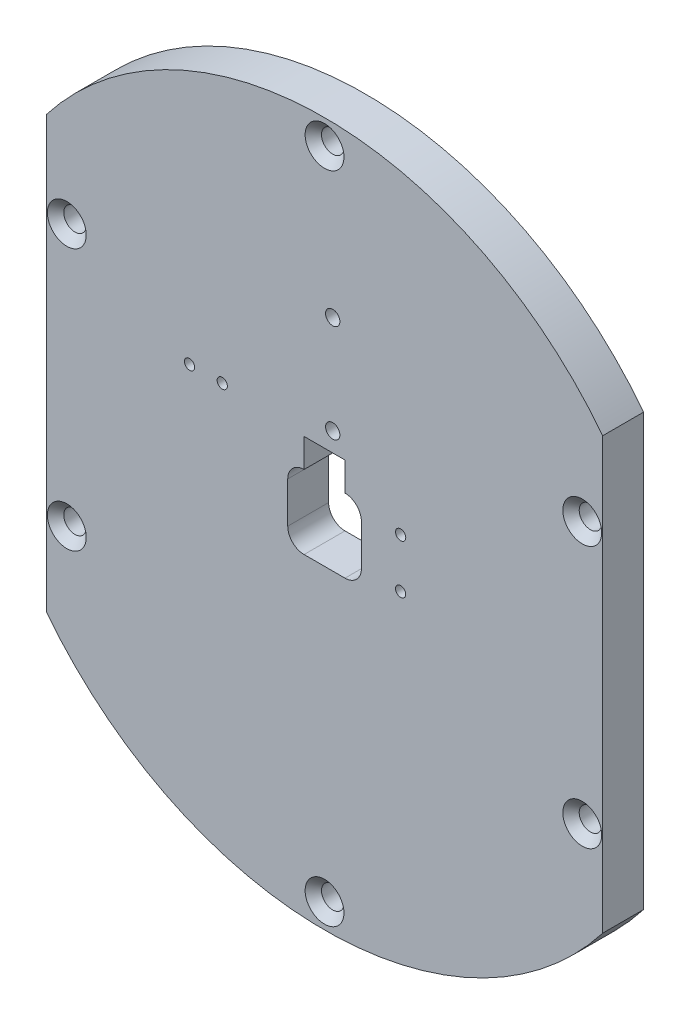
ISO-10303-21;
HEADER;
FILE_DESCRIPTION(('STEP AP214'),'2;1');
FILE_NAME('part.step','',(''),(''),'','','');
FILE_SCHEMA(('AUTOMOTIVE_DESIGN { 1 0 10303 214 1 1 1 1 }'));
ENDSEC;
DATA;
#1=APPLICATION_CONTEXT('core data for automotive mechanical design processes');
#2=APPLICATION_PROTOCOL_DEFINITION('international standard','automotive_design',2000,#1);
#3=PRODUCT_CONTEXT('',#1,'mechanical');
#4=PRODUCT('Part','Part','',(#3));
#5=PRODUCT_RELATED_PRODUCT_CATEGORY('part','',(#4));
#6=PRODUCT_DEFINITION_FORMATION('','',#4);
#7=PRODUCT_DEFINITION_CONTEXT('part definition',#1,'design');
#8=PRODUCT_DEFINITION('design','',#6,#7);
#9=PRODUCT_DEFINITION_SHAPE('','',#8);
#10=(LENGTH_UNIT() NAMED_UNIT(*) SI_UNIT(.MILLI.,.METRE.));
#11=(NAMED_UNIT(*) PLANE_ANGLE_UNIT() SI_UNIT($,.RADIAN.));
#12=(NAMED_UNIT(*) SI_UNIT($,.STERADIAN.) SOLID_ANGLE_UNIT());
#13=UNCERTAINTY_MEASURE_WITH_UNIT(LENGTH_MEASURE(1.E-05),#10,'distance_accuracy_value','');
#14=(GEOMETRIC_REPRESENTATION_CONTEXT(3) GLOBAL_UNCERTAINTY_ASSIGNED_CONTEXT((#13)) GLOBAL_UNIT_ASSIGNED_CONTEXT((#10,
#11,#12)) REPRESENTATION_CONTEXT('',''));
#15=CARTESIAN_POINT('',(0.,0.,0.));
#16=DIRECTION('',(0.,0.,1.));
#17=DIRECTION('',(1.,0.,0.));
#18=AXIS2_PLACEMENT_3D('',#15,#16,#17);
#19=CARTESIAN_POINT('',(0.,0.,0.));
#20=DIRECTION('',(0.,0.,1.));
#21=DIRECTION('',(1.,0.,0.));
#22=AXIS2_PLACEMENT_3D('',#19,#20,#21);
#23=PLANE('',#22);
#24=CARTESIAN_POINT('',(-33.,17.2589612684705,0.));
#25=DIRECTION('',(0.,0.,1.));
#26=DIRECTION('',(1.,0.,0.));
#27=AXIS2_PLACEMENT_3D('',#24,#25,#26);
#28=CIRCLE('',#27,1.24999999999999);
#29=CARTESIAN_POINT('',(-31.75,17.2589612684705,0.));
#30=VERTEX_POINT('',#29);
#31=EDGE_CURVE('E38',#30,#30,#28,.T.);
#32=ORIENTED_EDGE('',*,*,#31,.T.);
#33=EDGE_LOOP('',(#32));
#34=FACE_BOUND('',#33,.T.);
#35=CARTESIAN_POINT('',(-25.,17.2589612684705,0.));
#36=DIRECTION('',(0.,0.,1.));
#37=DIRECTION('',(1.,0.,0.));
#38=AXIS2_PLACEMENT_3D('',#35,#36,#37);
#39=CIRCLE('',#38,1.24999999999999);
#40=CARTESIAN_POINT('',(-23.75,17.2589612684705,0.));
#41=VERTEX_POINT('',#40);
#42=EDGE_CURVE('E391',#41,#41,#39,.T.);
#43=ORIENTED_EDGE('',*,*,#42,.T.);
#44=EDGE_LOOP('',(#43));
#45=FACE_BOUND('',#44,.T.);
#46=CARTESIAN_POINT('',(-63.,-32.,0.));
#47=DIRECTION('',(0.,0.,-1.));
#48=DIRECTION('',(1.,0.,0.));
#49=AXIS2_PLACEMENT_3D('',#46,#47,#48);
#50=CIRCLE('',#49,2.75);
#51=CARTESIAN_POINT('',(-60.25,-32.,0.));
#52=VERTEX_POINT('',#51);
#53=EDGE_CURVE('E390',#52,#52,#50,.T.);
#54=ORIENTED_EDGE('',*,*,#53,.F.);
#55=EDGE_LOOP('',(#54));
#56=FACE_BOUND('',#55,.T.);
#57=CARTESIAN_POINT('',(23.9054445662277,-41.4054445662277,0.));
#58=DIRECTION('',(0.,0.,1.));
#59=DIRECTION('',(1.,0.,0.));
#60=AXIS2_PLACEMENT_3D('',#57,#58,#59);
#61=CIRCLE('',#60,7.24873734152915);
#62=CARTESIAN_POINT('',(31.1541819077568,-41.4054445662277,0.));
#63=VERTEX_POINT('',#62);
#64=EDGE_CURVE('E273',#63,#63,#61,.F.);
#65=ORIENTED_EDGE('',*,*,#64,.F.);
#66=EDGE_LOOP('',(#65));
#67=FACE_BOUND('',#66,.T.);
#68=CARTESIAN_POINT('',(-23.9054445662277,41.4054445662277,0.));
#69=DIRECTION('',(0.,0.,1.));
#70=DIRECTION('',(1.,0.,0.));
#71=AXIS2_PLACEMENT_3D('',#68,#69,#70);
#72=CIRCLE('',#71,7.24873734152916);
#73=CARTESIAN_POINT('',(-16.6567072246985,41.4054445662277,0.));
#74=VERTEX_POINT('',#73);
#75=EDGE_CURVE('E267',#74,#74,#72,.F.);
#76=ORIENTED_EDGE('',*,*,#75,.F.);
#77=EDGE_LOOP('',(#76));
#78=FACE_BOUND('',#77,.T.);
#79=DIRECTION('',(0.,-1.,0.));
#80=VECTOR('',#79,1.);
#81=CARTESIAN_POINT('',(-5.,9.,0.));
#82=LINE('',#81,#80);
#83=CARTESIAN_POINT('',(-5.,16.,0.));
#84=VERTEX_POINT('',#83);
#85=CARTESIAN_POINT('',(-5.,9.,0.));
#86=VERTEX_POINT('',#85);
#87=EDGE_CURVE('E226',#84,#86,#82,.T.);
#88=ORIENTED_EDGE('',*,*,#87,.T.);
#89=CARTESIAN_POINT('',(-5.,5.,0.));
#90=DIRECTION('',(0.,0.,1.));
#91=DIRECTION('',(1.,0.,0.));
#92=AXIS2_PLACEMENT_3D('',#89,#90,#91);
#93=CIRCLE('',#92,4.);
#94=CARTESIAN_POINT('',(-9.,5.,0.));
#95=VERTEX_POINT('',#94);
#96=EDGE_CURVE('E162',#86,#95,#93,.T.);
#97=ORIENTED_EDGE('',*,*,#96,.T.);
#98=DIRECTION('',(0.,-1.,0.));
#99=VECTOR('',#98,1.);
#100=CARTESIAN_POINT('',(-9.,9.,0.));
#101=LINE('',#100,#99);
#102=CARTESIAN_POINT('',(-9.,-5.,0.));
#103=VERTEX_POINT('',#102);
#104=EDGE_CURVE('E179',#95,#103,#101,.T.);
#105=ORIENTED_EDGE('',*,*,#104,.T.);
#106=CARTESIAN_POINT('',(-5.,-5.,0.));
#107=DIRECTION('',(0.,0.,1.));
#108=DIRECTION('',(1.,0.,0.));
#109=AXIS2_PLACEMENT_3D('',#106,#107,#108);
#110=CIRCLE('',#109,4.);
#111=CARTESIAN_POINT('',(-5.,-9.,0.));
#112=VERTEX_POINT('',#111);
#113=EDGE_CURVE('E43',#103,#112,#110,.T.);
#114=ORIENTED_EDGE('',*,*,#113,.T.);
#115=DIRECTION('',(1.,0.,0.));
#116=VECTOR('',#115,1.);
#117=CARTESIAN_POINT('',(-9.,-9.,0.));
#118=LINE('',#117,#116);
#119=CARTESIAN_POINT('',(4.99999999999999,-9.,0.));
#120=VERTEX_POINT('',#119);
#121=EDGE_CURVE('E178',#112,#120,#118,.T.);
#122=ORIENTED_EDGE('',*,*,#121,.T.);
#123=CARTESIAN_POINT('',(4.99999999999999,-5.,0.));
#124=DIRECTION('',(0.,0.,1.));
#125=DIRECTION('',(1.,0.,0.));
#126=AXIS2_PLACEMENT_3D('',#123,#124,#125);
#127=CIRCLE('',#126,4.);
#128=CARTESIAN_POINT('',(8.99999999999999,-5.,0.));
#129=VERTEX_POINT('',#128);
#130=EDGE_CURVE('E207',#120,#129,#127,.T.);
#131=ORIENTED_EDGE('',*,*,#130,.T.);
#132=DIRECTION('',(0.,1.,0.));
#133=VECTOR('',#132,1.);
#134=CARTESIAN_POINT('',(9.,9.,0.));
#135=LINE('',#134,#133);
#136=CARTESIAN_POINT('',(9.,5.,0.));
#137=VERTEX_POINT('',#136);
#138=EDGE_CURVE('E191',#129,#137,#135,.T.);
#139=ORIENTED_EDGE('',*,*,#138,.T.);
#140=CARTESIAN_POINT('',(5.,5.,0.));
#141=DIRECTION('',(0.,0.,1.));
#142=DIRECTION('',(1.,0.,0.));
#143=AXIS2_PLACEMENT_3D('',#140,#141,#142);
#144=CIRCLE('',#143,4.);
#145=CARTESIAN_POINT('',(5.,9.,0.));
#146=VERTEX_POINT('',#145);
#147=EDGE_CURVE('E163',#137,#146,#144,.T.);
#148=ORIENTED_EDGE('',*,*,#147,.T.);
#149=DIRECTION('',(0.,1.,0.));
#150=VECTOR('',#149,1.);
#151=CARTESIAN_POINT('',(5.,9.,0.));
#152=LINE('',#151,#150);
#153=CARTESIAN_POINT('',(5.,16.,0.));
#154=VERTEX_POINT('',#153);
#155=EDGE_CURVE('E142',#146,#154,#152,.T.);
#156=ORIENTED_EDGE('',*,*,#155,.T.);
#157=DIRECTION('',(-1.,0.,0.));
#158=VECTOR('',#157,1.);
#159=CARTESIAN_POINT('',(-5.,16.,0.));
#160=LINE('',#159,#158);
#161=EDGE_CURVE('E220',#154,#84,#160,.T.);
#162=ORIENTED_EDGE('',*,*,#161,.T.);
#163=EDGE_LOOP('',(#88,#97,#105,#114,#122,#131,#139,#148,#156,#162));
#164=FACE_BOUND('',#163,.T.);
#165=CARTESIAN_POINT('',(0.,0.,0.));
#166=DIRECTION('',(0.,0.,1.));
#167=DIRECTION('',(1.,0.,0.));
#168=AXIS2_PLACEMENT_3D('',#165,#166,#167);
#169=CIRCLE('',#168,86.);
#170=CARTESIAN_POINT('',(-68.,-52.6497863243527,0.));
#171=VERTEX_POINT('',#170);
#172=CARTESIAN_POINT('',(68.,-52.6497863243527,0.));
#173=VERTEX_POINT('',#172);
#174=EDGE_CURVE('E145',#171,#173,#169,.T.);
#175=ORIENTED_EDGE('',*,*,#174,.F.);
#176=DIRECTION('',(0.,-1.,0.));
#177=VECTOR('',#176,1.);
#178=CARTESIAN_POINT('',(-68.,52.6497863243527,0.));
#179=LINE('',#178,#177);
#180=CARTESIAN_POINT('',(-68.,52.6497863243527,0.));
#181=VERTEX_POINT('',#180);
#182=EDGE_CURVE('E239',#181,#171,#179,.T.);
#183=ORIENTED_EDGE('',*,*,#182,.F.);
#184=CARTESIAN_POINT('',(0.,0.,0.));
#185=DIRECTION('',(0.,0.,1.));
#186=DIRECTION('',(1.,0.,0.));
#187=AXIS2_PLACEMENT_3D('',#184,#185,#186);
#188=CIRCLE('',#187,86.);
#189=CARTESIAN_POINT('',(68.,52.6497863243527,0.));
#190=VERTEX_POINT('',#189);
#191=EDGE_CURVE('E250',#190,#181,#188,.T.);
#192=ORIENTED_EDGE('',*,*,#191,.F.);
#193=DIRECTION('',(0.,1.,0.));
#194=VECTOR('',#193,1.);
#195=CARTESIAN_POINT('',(68.,52.6497863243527,0.));
#196=LINE('',#195,#194);
#197=EDGE_CURVE('E248',#173,#190,#196,.T.);
#198=ORIENTED_EDGE('',*,*,#197,.F.);
#199=EDGE_LOOP('',(#175,#183,#192,#198));
#200=FACE_BOUND('',#199,.T.);
#201=CARTESIAN_POINT('',(23.9054445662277,41.4054445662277,0.));
#202=DIRECTION('',(0.,0.,1.));
#203=DIRECTION('',(1.,0.,0.));
#204=AXIS2_PLACEMENT_3D('',#201,#202,#203);
#205=CIRCLE('',#204,7.24873734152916);
#206=CARTESIAN_POINT('',(31.1541819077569,41.4054445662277,0.));
#207=VERTEX_POINT('',#206);
#208=EDGE_CURVE('E264',#207,#207,#205,.F.);
#209=ORIENTED_EDGE('',*,*,#208,.F.);
#210=EDGE_LOOP('',(#209));
#211=FACE_BOUND('',#210,.T.);
#212=CARTESIAN_POINT('',(-23.9054445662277,-41.4054445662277,0.));
#213=DIRECTION('',(0.,0.,1.));
#214=DIRECTION('',(1.,0.,0.));
#215=AXIS2_PLACEMENT_3D('',#212,#213,#214);
#216=CIRCLE('',#215,7.24873734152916);
#217=CARTESIAN_POINT('',(-16.6567072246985,-41.4054445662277,0.));
#218=VERTEX_POINT('',#217);
#219=EDGE_CURVE('E270',#218,#218,#216,.F.);
#220=ORIENTED_EDGE('',*,*,#219,.F.);
#221=EDGE_LOOP('',(#220));
#222=FACE_BOUND('',#221,.T.);
#223=CARTESIAN_POINT('',(2.00000000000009,44.6709090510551,0.));
#224=DIRECTION('',(0.,0.,1.));
#225=DIRECTION('',(1.,0.,0.));
#226=AXIS2_PLACEMENT_3D('',#223,#224,#225);
#227=CIRCLE('',#226,1.75);
#228=CARTESIAN_POINT('',(3.75000000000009,44.6709090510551,0.));
#229=VERTEX_POINT('',#228);
#230=EDGE_CURVE('E431',#229,#229,#227,.T.);
#231=ORIENTED_EDGE('',*,*,#230,.T.);
#232=EDGE_LOOP('',(#231));
#233=FACE_BOUND('',#232,.T.);
#234=CARTESIAN_POINT('',(2.00000000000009,20.6709090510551,0.));
#235=DIRECTION('',(0.,0.,1.));
#236=DIRECTION('',(1.,0.,0.));
#237=AXIS2_PLACEMENT_3D('',#234,#235,#236);
#238=CIRCLE('',#237,1.75);
#239=CARTESIAN_POINT('',(3.75000000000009,20.6709090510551,0.));
#240=VERTEX_POINT('',#239);
#241=EDGE_CURVE('E425',#240,#240,#238,.T.);
#242=ORIENTED_EDGE('',*,*,#241,.T.);
#243=EDGE_LOOP('',(#242));
#244=FACE_BOUND('',#243,.T.);
#245=CARTESIAN_POINT('',(18.6000000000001,6.97316794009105,0.));
#246=DIRECTION('',(0.,0.,1.));
#247=DIRECTION('',(1.,0.,0.));
#248=AXIS2_PLACEMENT_3D('',#245,#246,#247);
#249=CIRCLE('',#248,1.25);
#250=CARTESIAN_POINT('',(19.8500000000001,6.97316794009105,0.));
#251=VERTEX_POINT('',#250);
#252=EDGE_CURVE('E419',#251,#251,#249,.T.);
#253=ORIENTED_EDGE('',*,*,#252,.T.);
#254=EDGE_LOOP('',(#253));
#255=FACE_BOUND('',#254,.T.);
#256=CARTESIAN_POINT('',(18.6000000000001,-5.02683205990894,0.));
#257=DIRECTION('',(0.,0.,1.));
#258=DIRECTION('',(1.,0.,0.));
#259=AXIS2_PLACEMENT_3D('',#256,#257,#258);
#260=CIRCLE('',#259,1.25);
#261=CARTESIAN_POINT('',(19.8500000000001,-5.02683205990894,0.));
#262=VERTEX_POINT('',#261);
#263=EDGE_CURVE('E413',#262,#262,#260,.T.);
#264=ORIENTED_EDGE('',*,*,#263,.T.);
#265=EDGE_LOOP('',(#264));
#266=FACE_BOUND('',#265,.T.);
#267=CARTESIAN_POINT('',(0.,80.,0.));
#268=DIRECTION('',(0.,0.,1.));
#269=DIRECTION('',(1.,0.,0.));
#270=AXIS2_PLACEMENT_3D('',#267,#268,#269);
#271=CIRCLE('',#270,2.75);
#272=CARTESIAN_POINT('',(2.75,80.,0.));
#273=VERTEX_POINT('',#272);
#274=EDGE_CURVE('E409',#273,#273,#271,.T.);
#275=ORIENTED_EDGE('',*,*,#274,.T.);
#276=EDGE_LOOP('',(#275));
#277=FACE_BOUND('',#276,.T.);
#278=CARTESIAN_POINT('',(-63.,32.,0.));
#279=DIRECTION('',(0.,0.,1.));
#280=DIRECTION('',(1.,0.,0.));
#281=AXIS2_PLACEMENT_3D('',#278,#279,#280);
#282=CIRCLE('',#281,2.75);
#283=CARTESIAN_POINT('',(-60.25,32.,0.));
#284=VERTEX_POINT('',#283);
#285=EDGE_CURVE('E406',#284,#284,#282,.T.);
#286=ORIENTED_EDGE('',*,*,#285,.T.);
#287=EDGE_LOOP('',(#286));
#288=FACE_BOUND('',#287,.T.);
#289=CARTESIAN_POINT('',(63.,32.,0.));
#290=DIRECTION('',(0.,0.,1.));
#291=DIRECTION('',(1.,0.,0.));
#292=AXIS2_PLACEMENT_3D('',#289,#290,#291);
#293=CIRCLE('',#292,2.75000000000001);
#294=CARTESIAN_POINT('',(65.75,32.,0.));
#295=VERTEX_POINT('',#294);
#296=EDGE_CURVE('E403',#295,#295,#293,.T.);
#297=ORIENTED_EDGE('',*,*,#296,.T.);
#298=EDGE_LOOP('',(#297));
#299=FACE_BOUND('',#298,.T.);
#300=CARTESIAN_POINT('',(0.,-80.,0.));
#301=DIRECTION('',(0.,0.,-1.));
#302=DIRECTION('',(1.,0.,0.));
#303=AXIS2_PLACEMENT_3D('',#300,#301,#302);
#304=CIRCLE('',#303,2.75);
#305=CARTESIAN_POINT('',(2.75,-80.,0.));
#306=VERTEX_POINT('',#305);
#307=EDGE_CURVE('E394',#306,#306,#304,.T.);
#308=ORIENTED_EDGE('',*,*,#307,.F.);
#309=EDGE_LOOP('',(#308));
#310=FACE_BOUND('',#309,.T.);
#311=CARTESIAN_POINT('',(63.,-32.,0.));
#312=DIRECTION('',(0.,0.,-1.));
#313=DIRECTION('',(1.,0.,0.));
#314=AXIS2_PLACEMENT_3D('',#311,#312,#313);
#315=CIRCLE('',#314,2.75000000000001);
#316=CARTESIAN_POINT('',(65.75,-32.,0.));
#317=VERTEX_POINT('',#316);
#318=EDGE_CURVE('E388',#317,#317,#315,.T.);
#319=ORIENTED_EDGE('',*,*,#318,.F.);
#320=EDGE_LOOP('',(#319));
#321=FACE_BOUND('',#320,.T.);
#322=ADVANCED_FACE('F34',(#34,#45,#56,#67,#78,#164,#200,#211,#222,#233,#244,#255,#266,#277,#288,
#299,#310,#321),#23,.F.);
#323=CARTESIAN_POINT('',(0.,0.,10.));
#324=DIRECTION('',(0.,0.,1.));
#325=DIRECTION('',(1.,0.,0.));
#326=AXIS2_PLACEMENT_3D('',#323,#324,#325);
#327=PLANE('',#326);
#328=CARTESIAN_POINT('',(-33.,17.2589612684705,10.));
#329=DIRECTION('',(0.,0.,1.));
#330=DIRECTION('',(1.,0.,0.));
#331=AXIS2_PLACEMENT_3D('',#328,#329,#330);
#332=CIRCLE('',#331,1.24999999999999);
#333=CARTESIAN_POINT('',(-31.75,17.2589612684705,10.));
#334=VERTEX_POINT('',#333);
#335=EDGE_CURVE('E552',#334,#334,#332,.T.);
#336=ORIENTED_EDGE('',*,*,#335,.F.);
#337=EDGE_LOOP('',(#336));
#338=FACE_BOUND('',#337,.T.);
#339=CARTESIAN_POINT('',(-25.,17.2589612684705,10.));
#340=DIRECTION('',(0.,0.,1.));
#341=DIRECTION('',(1.,0.,0.));
#342=AXIS2_PLACEMENT_3D('',#339,#340,#341);
#343=CIRCLE('',#342,1.24999999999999);
#344=CARTESIAN_POINT('',(-23.75,17.2589612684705,10.));
#345=VERTEX_POINT('',#344);
#346=EDGE_CURVE('E397',#345,#345,#343,.T.);
#347=ORIENTED_EDGE('',*,*,#346,.F.);
#348=EDGE_LOOP('',(#347));
#349=FACE_BOUND('',#348,.T.);
#350=CARTESIAN_POINT('',(63.,-32.,10.));
#351=DIRECTION('',(0.,0.,1.));
#352=DIRECTION('',(1.,0.,0.));
#353=AXIS2_PLACEMENT_3D('',#350,#351,#352);
#354=CIRCLE('',#353,4.75000000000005);
#355=CARTESIAN_POINT('',(67.7500000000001,-32.,10.));
#356=VERTEX_POINT('',#355);
#357=EDGE_CURVE('E300',#356,#356,#354,.F.);
#358=ORIENTED_EDGE('',*,*,#357,.T.);
#359=EDGE_LOOP('',(#358));
#360=FACE_BOUND('',#359,.T.);
#361=CARTESIAN_POINT('',(0.,-80.,10.));
#362=DIRECTION('',(0.,0.,1.));
#363=DIRECTION('',(1.,0.,0.));
#364=AXIS2_PLACEMENT_3D('',#361,#362,#363);
#365=CIRCLE('',#364,4.75000000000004);
#366=CARTESIAN_POINT('',(4.75000000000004,-80.,10.));
#367=VERTEX_POINT('',#366);
#368=EDGE_CURVE('E297',#367,#367,#365,.F.);
#369=ORIENTED_EDGE('',*,*,#368,.T.);
#370=EDGE_LOOP('',(#369));
#371=FACE_BOUND('',#370,.T.);
#372=CARTESIAN_POINT('',(-63.,-32.,10.));
#373=DIRECTION('',(0.,0.,1.));
#374=DIRECTION('',(1.,0.,0.));
#375=AXIS2_PLACEMENT_3D('',#372,#373,#374);
#376=CIRCLE('',#375,4.75000000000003);
#377=CARTESIAN_POINT('',(-58.25,-32.,10.));
#378=VERTEX_POINT('',#377);
#379=EDGE_CURVE('E294',#378,#378,#376,.F.);
#380=ORIENTED_EDGE('',*,*,#379,.T.);
#381=EDGE_LOOP('',(#380));
#382=FACE_BOUND('',#381,.T.);
#383=DIRECTION('',(1.,0.,0.));
#384=VECTOR('',#383,1.);
#385=CARTESIAN_POINT('',(-9.,-9.,10.));
#386=LINE('',#385,#384);
#387=CARTESIAN_POINT('',(-5.,-9.,10.));
#388=VERTEX_POINT('',#387);
#389=CARTESIAN_POINT('',(4.99999999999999,-9.,10.));
#390=VERTEX_POINT('',#389);
#391=EDGE_CURVE('E209',#388,#390,#386,.T.);
#392=ORIENTED_EDGE('',*,*,#391,.F.);
#393=CARTESIAN_POINT('',(-5.,-5.,10.));
#394=DIRECTION('',(0.,0.,1.));
#395=DIRECTION('',(1.,0.,0.));
#396=AXIS2_PLACEMENT_3D('',#393,#394,#395);
#397=CIRCLE('',#396,4.);
#398=CARTESIAN_POINT('',(-9.,-5.,10.));
#399=VERTEX_POINT('',#398);
#400=EDGE_CURVE('E11',#388,#399,#397,.F.);
#401=ORIENTED_EDGE('',*,*,#400,.T.);
#402=DIRECTION('',(0.,-1.,0.));
#403=VECTOR('',#402,1.);
#404=CARTESIAN_POINT('',(-9.,9.,10.));
#405=LINE('',#404,#403);
#406=CARTESIAN_POINT('',(-9.,5.,10.));
#407=VERTEX_POINT('',#406);
#408=EDGE_CURVE('E212',#407,#399,#405,.T.);
#409=ORIENTED_EDGE('',*,*,#408,.F.);
#410=CARTESIAN_POINT('',(-5.,5.,10.));
#411=DIRECTION('',(0.,0.,1.));
#412=DIRECTION('',(1.,0.,0.));
#413=AXIS2_PLACEMENT_3D('',#410,#411,#412);
#414=CIRCLE('',#413,4.);
#415=CARTESIAN_POINT('',(-5.,9.,10.));
#416=VERTEX_POINT('',#415);
#417=EDGE_CURVE('E165',#407,#416,#414,.F.);
#418=ORIENTED_EDGE('',*,*,#417,.T.);
#419=DIRECTION('',(0.,-1.,0.));
#420=VECTOR('',#419,1.);
#421=CARTESIAN_POINT('',(-5.,9.,10.));
#422=LINE('',#421,#420);
#423=CARTESIAN_POINT('',(-5.,16.,10.));
#424=VERTEX_POINT('',#423);
#425=EDGE_CURVE('E232',#424,#416,#422,.T.);
#426=ORIENTED_EDGE('',*,*,#425,.F.);
#427=DIRECTION('',(-1.,0.,0.));
#428=VECTOR('',#427,1.);
#429=CARTESIAN_POINT('',(-5.,16.,10.));
#430=LINE('',#429,#428);
#431=CARTESIAN_POINT('',(5.,16.,10.));
#432=VERTEX_POINT('',#431);
#433=EDGE_CURVE('E155',#432,#424,#430,.T.);
#434=ORIENTED_EDGE('',*,*,#433,.F.);
#435=DIRECTION('',(0.,1.,0.));
#436=VECTOR('',#435,1.);
#437=CARTESIAN_POINT('',(5.,9.,10.));
#438=LINE('',#437,#436);
#439=CARTESIAN_POINT('',(5.,9.,10.));
#440=VERTEX_POINT('',#439);
#441=EDGE_CURVE('E139',#440,#432,#438,.T.);
#442=ORIENTED_EDGE('',*,*,#441,.F.);
#443=CARTESIAN_POINT('',(5.,5.,10.));
#444=DIRECTION('',(0.,0.,1.));
#445=DIRECTION('',(1.,0.,0.));
#446=AXIS2_PLACEMENT_3D('',#443,#444,#445);
#447=CIRCLE('',#446,4.);
#448=CARTESIAN_POINT('',(9.,5.,10.));
#449=VERTEX_POINT('',#448);
#450=EDGE_CURVE('E152',#440,#449,#447,.F.);
#451=ORIENTED_EDGE('',*,*,#450,.T.);
#452=DIRECTION('',(0.,1.,0.));
#453=VECTOR('',#452,1.);
#454=CARTESIAN_POINT('',(9.,9.,10.));
#455=LINE('',#454,#453);
#456=CARTESIAN_POINT('',(8.99999999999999,-5.,10.));
#457=VERTEX_POINT('',#456);
#458=EDGE_CURVE('E156',#457,#449,#455,.T.);
#459=ORIENTED_EDGE('',*,*,#458,.F.);
#460=CARTESIAN_POINT('',(4.99999999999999,-5.,10.));
#461=DIRECTION('',(0.,0.,1.));
#462=DIRECTION('',(1.,0.,0.));
#463=AXIS2_PLACEMENT_3D('',#460,#461,#462);
#464=CIRCLE('',#463,4.);
#465=EDGE_CURVE('E167',#457,#390,#464,.F.);
#466=ORIENTED_EDGE('',*,*,#465,.T.);
#467=EDGE_LOOP('',(#392,#401,#409,#418,#426,#434,#442,#451,#459,#466));
#468=FACE_BOUND('',#467,.T.);
#469=CARTESIAN_POINT('',(0.,0.,10.));
#470=DIRECTION('',(0.,0.,1.));
#471=DIRECTION('',(1.,0.,0.));
#472=AXIS2_PLACEMENT_3D('',#469,#470,#471);
#473=CIRCLE('',#472,86.);
#474=CARTESIAN_POINT('',(-68.,-52.6497863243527,10.));
#475=VERTEX_POINT('',#474);
#476=CARTESIAN_POINT('',(68.,-52.6497863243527,10.));
#477=VERTEX_POINT('',#476);
#478=EDGE_CURVE('E235',#475,#477,#473,.T.);
#479=ORIENTED_EDGE('',*,*,#478,.T.);
#480=DIRECTION('',(0.,1.,0.));
#481=VECTOR('',#480,1.);
#482=CARTESIAN_POINT('',(68.,52.6497863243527,10.));
#483=LINE('',#482,#481);
#484=CARTESIAN_POINT('',(68.,52.6497863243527,10.));
#485=VERTEX_POINT('',#484);
#486=EDGE_CURVE('E238',#477,#485,#483,.T.);
#487=ORIENTED_EDGE('',*,*,#486,.T.);
#488=CARTESIAN_POINT('',(0.,0.,10.));
#489=DIRECTION('',(0.,0.,1.));
#490=DIRECTION('',(1.,0.,0.));
#491=AXIS2_PLACEMENT_3D('',#488,#489,#490);
#492=CIRCLE('',#491,86.);
#493=CARTESIAN_POINT('',(-68.,52.6497863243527,10.));
#494=VERTEX_POINT('',#493);
#495=EDGE_CURVE('E241',#485,#494,#492,.T.);
#496=ORIENTED_EDGE('',*,*,#495,.T.);
#497=DIRECTION('',(0.,-1.,0.));
#498=VECTOR('',#497,1.);
#499=CARTESIAN_POINT('',(-68.,52.6497863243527,10.));
#500=LINE('',#499,#498);
#501=EDGE_CURVE('E243',#494,#475,#500,.T.);
#502=ORIENTED_EDGE('',*,*,#501,.T.);
#503=EDGE_LOOP('',(#479,#487,#496,#502));
#504=FACE_BOUND('',#503,.T.);
#505=CARTESIAN_POINT('',(2.00000000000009,44.6709090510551,10.));
#506=DIRECTION('',(0.,0.,1.));
#507=DIRECTION('',(1.,0.,0.));
#508=AXIS2_PLACEMENT_3D('',#505,#506,#507);
#509=CIRCLE('',#508,1.75);
#510=CARTESIAN_POINT('',(3.75000000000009,44.6709090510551,10.));
#511=VERTEX_POINT('',#510);
#512=EDGE_CURVE('E428',#511,#511,#509,.T.);
#513=ORIENTED_EDGE('',*,*,#512,.F.);
#514=EDGE_LOOP('',(#513));
#515=FACE_BOUND('',#514,.T.);
#516=CARTESIAN_POINT('',(2.00000000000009,20.6709090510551,10.));
#517=DIRECTION('',(0.,0.,1.));
#518=DIRECTION('',(1.,0.,0.));
#519=AXIS2_PLACEMENT_3D('',#516,#517,#518);
#520=CIRCLE('',#519,1.75);
#521=CARTESIAN_POINT('',(3.75000000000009,20.6709090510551,10.));
#522=VERTEX_POINT('',#521);
#523=EDGE_CURVE('E422',#522,#522,#520,.T.);
#524=ORIENTED_EDGE('',*,*,#523,.F.);
#525=EDGE_LOOP('',(#524));
#526=FACE_BOUND('',#525,.T.);
#527=CARTESIAN_POINT('',(18.6000000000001,6.97316794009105,10.));
#528=DIRECTION('',(0.,0.,1.));
#529=DIRECTION('',(1.,0.,0.));
#530=AXIS2_PLACEMENT_3D('',#527,#528,#529);
#531=CIRCLE('',#530,1.25);
#532=CARTESIAN_POINT('',(19.8500000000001,6.97316794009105,10.));
#533=VERTEX_POINT('',#532);
#534=EDGE_CURVE('E416',#533,#533,#531,.T.);
#535=ORIENTED_EDGE('',*,*,#534,.F.);
#536=EDGE_LOOP('',(#535));
#537=FACE_BOUND('',#536,.T.);
#538=CARTESIAN_POINT('',(18.6000000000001,-5.02683205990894,10.));
#539=DIRECTION('',(0.,0.,1.));
#540=DIRECTION('',(1.,0.,0.));
#541=AXIS2_PLACEMENT_3D('',#538,#539,#540);
#542=CIRCLE('',#541,1.25);
#543=CARTESIAN_POINT('',(19.8500000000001,-5.02683205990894,10.));
#544=VERTEX_POINT('',#543);
#545=EDGE_CURVE('E412',#544,#544,#542,.T.);
#546=ORIENTED_EDGE('',*,*,#545,.F.);
#547=EDGE_LOOP('',(#546));
#548=FACE_BOUND('',#547,.T.);
#549=CARTESIAN_POINT('',(-63.,32.,10.));
#550=DIRECTION('',(0.,0.,1.));
#551=DIRECTION('',(1.,0.,0.));
#552=AXIS2_PLACEMENT_3D('',#549,#550,#551);
#553=CIRCLE('',#552,4.75000000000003);
#554=CARTESIAN_POINT('',(-58.25,32.,10.));
#555=VERTEX_POINT('',#554);
#556=EDGE_CURVE('E279',#555,#555,#553,.F.);
#557=ORIENTED_EDGE('',*,*,#556,.T.);
#558=EDGE_LOOP('',(#557));
#559=FACE_BOUND('',#558,.T.);
#560=CARTESIAN_POINT('',(0.,80.,10.));
#561=DIRECTION('',(0.,0.,1.));
#562=DIRECTION('',(1.,0.,0.));
#563=AXIS2_PLACEMENT_3D('',#560,#561,#562);
#564=CIRCLE('',#563,4.75000000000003);
#565=CARTESIAN_POINT('',(4.75000000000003,80.,10.));
#566=VERTEX_POINT('',#565);
#567=EDGE_CURVE('E282',#566,#566,#564,.F.);
#568=ORIENTED_EDGE('',*,*,#567,.T.);
#569=EDGE_LOOP('',(#568));
#570=FACE_BOUND('',#569,.T.);
#571=CARTESIAN_POINT('',(63.,32.,10.));
#572=DIRECTION('',(0.,0.,1.));
#573=DIRECTION('',(1.,0.,0.));
#574=AXIS2_PLACEMENT_3D('',#571,#572,#573);
#575=CIRCLE('',#574,4.75000000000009);
#576=CARTESIAN_POINT('',(67.7500000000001,32.,10.));
#577=VERTEX_POINT('',#576);
#578=EDGE_CURVE('E285',#577,#577,#575,.F.);
#579=ORIENTED_EDGE('',*,*,#578,.T.);
#580=EDGE_LOOP('',(#579));
#581=FACE_BOUND('',#580,.T.);
#582=ADVANCED_FACE('F149',(#338,#349,#360,#371,#382,#468,#504,#515,#526,#537,#548,#559,#570,
#581),#327,.T.);
#583=CARTESIAN_POINT('',(0.,0.,10.));
#584=DIRECTION('',(0.,0.,-1.));
#585=DIRECTION('',(-1.,0.,0.));
#586=AXIS2_PLACEMENT_3D('',#583,#584,#585);
#587=CYLINDRICAL_SURFACE('',#586,86.);
#588=ORIENTED_EDGE('',*,*,#174,.T.);
#589=DIRECTION('',(0.,0.,-1.));
#590=VECTOR('',#589,1.);
#591=CARTESIAN_POINT('',(68.,-52.6497863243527,10.));
#592=LINE('',#591,#590);
#593=EDGE_CURVE('E261',#477,#173,#592,.T.);
#594=ORIENTED_EDGE('',*,*,#593,.F.);
#595=ORIENTED_EDGE('',*,*,#478,.F.);
#596=DIRECTION('',(0.,0.,-1.));
#597=VECTOR('',#596,1.);
#598=CARTESIAN_POINT('',(-68.,-52.6497863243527,10.));
#599=LINE('',#598,#597);
#600=EDGE_CURVE('E245',#475,#171,#599,.T.);
#601=ORIENTED_EDGE('',*,*,#600,.T.);
#602=EDGE_LOOP('',(#588,#594,#595,#601));
#603=FACE_BOUND('',#602,.T.);
#604=ADVANCED_FACE('F321',(#603),#587,.T.);
#605=CARTESIAN_POINT('',(68.,52.6497863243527,10.));
#606=DIRECTION('',(-1.,0.,0.));
#607=DIRECTION('',(0.,0.,1.));
#608=AXIS2_PLACEMENT_3D('',#605,#606,#607);
#609=PLANE('',#608);
#610=ORIENTED_EDGE('',*,*,#197,.T.);
#611=DIRECTION('',(0.,0.,-1.));
#612=VECTOR('',#611,1.);
#613=CARTESIAN_POINT('',(68.,52.6497863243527,10.));
#614=LINE('',#613,#612);
#615=EDGE_CURVE('E258',#485,#190,#614,.T.);
#616=ORIENTED_EDGE('',*,*,#615,.F.);
#617=ORIENTED_EDGE('',*,*,#486,.F.);
#618=ORIENTED_EDGE('',*,*,#593,.T.);
#619=EDGE_LOOP('',(#610,#616,#617,#618));
#620=FACE_BOUND('',#619,.T.);
#621=ADVANCED_FACE('F351',(#620),#609,.F.);
#622=CARTESIAN_POINT('',(0.,0.,10.));
#623=DIRECTION('',(0.,0.,-1.));
#624=DIRECTION('',(-1.,0.,0.));
#625=AXIS2_PLACEMENT_3D('',#622,#623,#624);
#626=CYLINDRICAL_SURFACE('',#625,86.);
#627=ORIENTED_EDGE('',*,*,#191,.T.);
#628=DIRECTION('',(0.,0.,-1.));
#629=VECTOR('',#628,1.);
#630=CARTESIAN_POINT('',(-68.,52.6497863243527,10.));
#631=LINE('',#630,#629);
#632=EDGE_CURVE('E255',#494,#181,#631,.T.);
#633=ORIENTED_EDGE('',*,*,#632,.F.);
#634=ORIENTED_EDGE('',*,*,#495,.F.);
#635=ORIENTED_EDGE('',*,*,#615,.T.);
#636=EDGE_LOOP('',(#627,#633,#634,#635));
#637=FACE_BOUND('',#636,.T.);
#638=ADVANCED_FACE('F347',(#637),#626,.T.);
#639=CARTESIAN_POINT('',(-68.,52.6497863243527,10.));
#640=DIRECTION('',(1.,0.,0.));
#641=DIRECTION('',(0.,0.,-1.));
#642=AXIS2_PLACEMENT_3D('',#639,#640,#641);
#643=PLANE('',#642);
#644=ORIENTED_EDGE('',*,*,#182,.T.);
#645=ORIENTED_EDGE('',*,*,#600,.F.);
#646=ORIENTED_EDGE('',*,*,#501,.F.);
#647=ORIENTED_EDGE('',*,*,#632,.T.);
#648=EDGE_LOOP('',(#644,#645,#646,#647));
#649=FACE_BOUND('',#648,.T.);
#650=ADVANCED_FACE('F343',(#649),#643,.F.);
#651=CARTESIAN_POINT('',(-9.,9.,10.));
#652=DIRECTION('',(1.,0.,0.));
#653=DIRECTION('',(0.,0.,-1.));
#654=AXIS2_PLACEMENT_3D('',#651,#652,#653);
#655=PLANE('',#654);
#656=ORIENTED_EDGE('',*,*,#104,.F.);
#657=DIRECTION('',(0.,0.,-1.));
#658=VECTOR('',#657,1.);
#659=CARTESIAN_POINT('',(-9.,5.,10.));
#660=LINE('',#659,#658);
#661=EDGE_CURVE('E55',#95,#407,#660,.F.);
#662=ORIENTED_EDGE('',*,*,#661,.T.);
#663=ORIENTED_EDGE('',*,*,#408,.T.);
#664=DIRECTION('',(0.,0.,-1.));
#665=VECTOR('',#664,1.);
#666=CARTESIAN_POINT('',(-9.,-5.,0.));
#667=LINE('',#666,#665);
#668=EDGE_CURVE('E204',#399,#103,#667,.T.);
#669=ORIENTED_EDGE('',*,*,#668,.T.);
#670=EDGE_LOOP('',(#656,#662,#663,#669));
#671=FACE_BOUND('',#670,.T.);
#672=ADVANCED_FACE('F346',(#671),#655,.T.);
#673=CARTESIAN_POINT('',(-9.,-9.,10.));
#674=DIRECTION('',(0.,1.,0.));
#675=DIRECTION('',(0.,0.,1.));
#676=AXIS2_PLACEMENT_3D('',#673,#674,#675);
#677=PLANE('',#676);
#678=ORIENTED_EDGE('',*,*,#391,.T.);
#679=DIRECTION('',(0.,0.,-1.));
#680=VECTOR('',#679,1.);
#681=CARTESIAN_POINT('',(4.99999999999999,-9.,0.));
#682=LINE('',#681,#680);
#683=EDGE_CURVE('E190',#390,#120,#682,.T.);
#684=ORIENTED_EDGE('',*,*,#683,.T.);
#685=ORIENTED_EDGE('',*,*,#121,.F.);
#686=DIRECTION('',(0.,0.,-1.));
#687=VECTOR('',#686,1.);
#688=CARTESIAN_POINT('',(-5.,-9.,10.));
#689=LINE('',#688,#687);
#690=EDGE_CURVE('E188',#112,#388,#689,.F.);
#691=ORIENTED_EDGE('',*,*,#690,.T.);
#692=EDGE_LOOP('',(#678,#684,#685,#691));
#693=FACE_BOUND('',#692,.T.);
#694=ADVANCED_FACE('F187',(#693),#677,.T.);
#695=CARTESIAN_POINT('',(9.,9.,10.));
#696=DIRECTION('',(-1.,0.,0.));
#697=DIRECTION('',(0.,-1.,0.));
#698=AXIS2_PLACEMENT_3D('',#695,#696,#697);
#699=PLANE('',#698);
#700=ORIENTED_EDGE('',*,*,#138,.F.);
#701=DIRECTION('',(0.,0.,-1.));
#702=VECTOR('',#701,1.);
#703=CARTESIAN_POINT('',(8.99999999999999,-5.,10.));
#704=LINE('',#703,#702);
#705=EDGE_CURVE('E202',#129,#457,#704,.F.);
#706=ORIENTED_EDGE('',*,*,#705,.T.);
#707=ORIENTED_EDGE('',*,*,#458,.T.);
#708=DIRECTION('',(0.,0.,-1.));
#709=VECTOR('',#708,1.);
#710=CARTESIAN_POINT('',(9.,5.,0.));
#711=LINE('',#710,#709);
#712=EDGE_CURVE('E161',#449,#137,#711,.T.);
#713=ORIENTED_EDGE('',*,*,#712,.T.);
#714=EDGE_LOOP('',(#700,#706,#707,#713));
#715=FACE_BOUND('',#714,.T.);
#716=ADVANCED_FACE('F218',(#715),#699,.T.);
#717=CARTESIAN_POINT('',(5.,9.,10.));
#718=DIRECTION('',(-1.,0.,0.));
#719=DIRECTION('',(0.,-1.,0.));
#720=AXIS2_PLACEMENT_3D('',#717,#718,#719);
#721=PLANE('',#720);
#722=ORIENTED_EDGE('',*,*,#155,.F.);
#723=DIRECTION('',(0.,0.,-1.));
#724=VECTOR('',#723,1.);
#725=CARTESIAN_POINT('',(5.,9.,10.));
#726=LINE('',#725,#724);
#727=EDGE_CURVE('E136',#440,#146,#726,.T.);
#728=ORIENTED_EDGE('',*,*,#727,.F.);
#729=ORIENTED_EDGE('',*,*,#441,.T.);
#730=DIRECTION('',(0.,0.,-1.));
#731=VECTOR('',#730,1.);
#732=CARTESIAN_POINT('',(5.,16.,10.));
#733=LINE('',#732,#731);
#734=EDGE_CURVE('E146',#432,#154,#733,.T.);
#735=ORIENTED_EDGE('',*,*,#734,.T.);
#736=EDGE_LOOP('',(#722,#728,#729,#735));
#737=FACE_BOUND('',#736,.T.);
#738=ADVANCED_FACE('F138',(#737),#721,.T.);
#739=CARTESIAN_POINT('',(-5.,16.,10.));
#740=DIRECTION('',(0.,-1.,0.));
#741=DIRECTION('',(0.,0.,-1.));
#742=AXIS2_PLACEMENT_3D('',#739,#740,#741);
#743=PLANE('',#742);
#744=ORIENTED_EDGE('',*,*,#161,.F.);
#745=ORIENTED_EDGE('',*,*,#734,.F.);
#746=ORIENTED_EDGE('',*,*,#433,.T.);
#747=DIRECTION('',(0.,0.,-1.));
#748=VECTOR('',#747,1.);
#749=CARTESIAN_POINT('',(-5.,16.,10.));
#750=LINE('',#749,#748);
#751=EDGE_CURVE('E231',#424,#84,#750,.T.);
#752=ORIENTED_EDGE('',*,*,#751,.T.);
#753=EDGE_LOOP('',(#744,#745,#746,#752));
#754=FACE_BOUND('',#753,.T.);
#755=ADVANCED_FACE('F470',(#754),#743,.T.);
#756=CARTESIAN_POINT('',(-5.,9.,10.));
#757=DIRECTION('',(1.,0.,0.));
#758=DIRECTION('',(0.,0.,-1.));
#759=AXIS2_PLACEMENT_3D('',#756,#757,#758);
#760=PLANE('',#759);
#761=ORIENTED_EDGE('',*,*,#87,.F.);
#762=ORIENTED_EDGE('',*,*,#751,.F.);
#763=ORIENTED_EDGE('',*,*,#425,.T.);
#764=DIRECTION('',(0.,0.,-1.));
#765=VECTOR('',#764,1.);
#766=CARTESIAN_POINT('',(-5.,9.,10.));
#767=LINE('',#766,#765);
#768=EDGE_CURVE('E228',#416,#86,#767,.T.);
#769=ORIENTED_EDGE('',*,*,#768,.T.);
#770=EDGE_LOOP('',(#761,#762,#763,#769));
#771=FACE_BOUND('',#770,.T.);
#772=ADVANCED_FACE('F456',(#771),#760,.T.);
#773=CARTESIAN_POINT('',(23.9054445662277,41.4054445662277,-10.));
#774=DIRECTION('',(0.,0.,1.));
#775=DIRECTION('',(1.,0.,0.));
#776=AXIS2_PLACEMENT_3D('',#773,#774,#775);
#777=CYLINDRICAL_SURFACE('',#776,7.24873734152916);
#778=CARTESIAN_POINT('',(23.9054445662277,41.4054445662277,-10.));
#779=DIRECTION('',(0.,0.,-1.));
#780=DIRECTION('',(-1.,0.,0.));
#781=AXIS2_PLACEMENT_3D('',#778,#779,#780);
#782=CIRCLE('',#781,7.24873734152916);
#783=CARTESIAN_POINT('',(16.6567072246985,41.4054445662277,-10.));
#784=VERTEX_POINT('',#783);
#785=EDGE_CURVE('E445',#784,#784,#782,.T.);
#786=ORIENTED_EDGE('',*,*,#785,.F.);
#787=EDGE_LOOP('',(#786));
#788=FACE_BOUND('',#787,.T.);
#789=ORIENTED_EDGE('',*,*,#208,.T.);
#790=EDGE_LOOP('',(#789));
#791=FACE_BOUND('',#790,.T.);
#792=ADVANCED_FACE('F476',(#788,#791),#777,.T.);
#793=CARTESIAN_POINT('',(23.9054445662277,41.4054445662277,-10.));
#794=DIRECTION('',(0.,0.,-1.));
#795=DIRECTION('',(-1.,0.,0.));
#796=AXIS2_PLACEMENT_3D('',#793,#794,#795);
#797=PLANE('',#796);
#798=ORIENTED_EDGE('',*,*,#785,.T.);
#799=EDGE_LOOP('',(#798));
#800=FACE_BOUND('',#799,.T.);
#801=ADVANCED_FACE('F479',(#800),#797,.T.);
#802=CARTESIAN_POINT('',(-23.9054445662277,41.4054445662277,-10.));
#803=DIRECTION('',(0.,0.,1.));
#804=DIRECTION('',(1.,0.,0.));
#805=AXIS2_PLACEMENT_3D('',#802,#803,#804);
#806=CYLINDRICAL_SURFACE('',#805,7.24873734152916);
#807=CARTESIAN_POINT('',(-23.9054445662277,41.4054445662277,-10.));
#808=DIRECTION('',(0.,0.,-1.));
#809=DIRECTION('',(-1.,0.,0.));
#810=AXIS2_PLACEMENT_3D('',#807,#808,#809);
#811=CIRCLE('',#810,7.24873734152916);
#812=CARTESIAN_POINT('',(-31.1541819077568,41.4054445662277,-10.));
#813=VERTEX_POINT('',#812);
#814=EDGE_CURVE('E442',#813,#813,#811,.T.);
#815=ORIENTED_EDGE('',*,*,#814,.F.);
#816=EDGE_LOOP('',(#815));
#817=FACE_BOUND('',#816,.T.);
#818=ORIENTED_EDGE('',*,*,#75,.T.);
#819=EDGE_LOOP('',(#818));
#820=FACE_BOUND('',#819,.T.);
#821=ADVANCED_FACE('F483',(#817,#820),#806,.T.);
#822=CARTESIAN_POINT('',(-23.9054445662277,41.4054445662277,-10.));
#823=DIRECTION('',(0.,0.,-1.));
#824=DIRECTION('',(-1.,0.,0.));
#825=AXIS2_PLACEMENT_3D('',#822,#823,#824);
#826=PLANE('',#825);
#827=ORIENTED_EDGE('',*,*,#814,.T.);
#828=EDGE_LOOP('',(#827));
#829=FACE_BOUND('',#828,.T.);
#830=ADVANCED_FACE('F487',(#829),#826,.T.);
#831=CARTESIAN_POINT('',(-23.9054445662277,-41.4054445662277,-10.));
#832=DIRECTION('',(0.,0.,1.));
#833=DIRECTION('',(1.,0.,0.));
#834=AXIS2_PLACEMENT_3D('',#831,#832,#833);
#835=CYLINDRICAL_SURFACE('',#834,7.24873734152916);
#836=CARTESIAN_POINT('',(-23.9054445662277,-41.4054445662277,-10.));
#837=DIRECTION('',(0.,0.,-1.));
#838=DIRECTION('',(-1.,0.,0.));
#839=AXIS2_PLACEMENT_3D('',#836,#837,#838);
#840=CIRCLE('',#839,7.24873734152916);
#841=CARTESIAN_POINT('',(-31.1541819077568,-41.4054445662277,-10.));
#842=VERTEX_POINT('',#841);
#843=EDGE_CURVE('E439',#842,#842,#840,.T.);
#844=ORIENTED_EDGE('',*,*,#843,.F.);
#845=EDGE_LOOP('',(#844));
#846=FACE_BOUND('',#845,.T.);
#847=ORIENTED_EDGE('',*,*,#219,.T.);
#848=EDGE_LOOP('',(#847));
#849=FACE_BOUND('',#848,.T.);
#850=ADVANCED_FACE('F491',(#846,#849),#835,.T.);
#851=CARTESIAN_POINT('',(-23.9054445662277,-41.4054445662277,-10.));
#852=DIRECTION('',(0.,0.,-1.));
#853=DIRECTION('',(-1.,0.,0.));
#854=AXIS2_PLACEMENT_3D('',#851,#852,#853);
#855=PLANE('',#854);
#856=ORIENTED_EDGE('',*,*,#843,.T.);
#857=EDGE_LOOP('',(#856));
#858=FACE_BOUND('',#857,.T.);
#859=ADVANCED_FACE('F495',(#858),#855,.T.);
#860=CARTESIAN_POINT('',(23.9054445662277,-41.4054445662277,-10.));
#861=DIRECTION('',(0.,0.,1.));
#862=DIRECTION('',(1.,0.,0.));
#863=AXIS2_PLACEMENT_3D('',#860,#861,#862);
#864=CYLINDRICAL_SURFACE('',#863,7.24873734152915);
#865=CARTESIAN_POINT('',(23.9054445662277,-41.4054445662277,-10.));
#866=DIRECTION('',(0.,0.,-1.));
#867=DIRECTION('',(-1.,0.,0.));
#868=AXIS2_PLACEMENT_3D('',#865,#866,#867);
#869=CIRCLE('',#868,7.24873734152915);
#870=CARTESIAN_POINT('',(16.6567072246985,-41.4054445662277,-10.));
#871=VERTEX_POINT('',#870);
#872=EDGE_CURVE('E434',#871,#871,#869,.T.);
#873=ORIENTED_EDGE('',*,*,#872,.F.);
#874=EDGE_LOOP('',(#873));
#875=FACE_BOUND('',#874,.T.);
#876=ORIENTED_EDGE('',*,*,#64,.T.);
#877=EDGE_LOOP('',(#876));
#878=FACE_BOUND('',#877,.T.);
#879=ADVANCED_FACE('F499',(#875,#878),#864,.T.);
#880=CARTESIAN_POINT('',(23.9054445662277,-41.4054445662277,-10.));
#881=DIRECTION('',(0.,0.,-1.));
#882=DIRECTION('',(-1.,0.,0.));
#883=AXIS2_PLACEMENT_3D('',#880,#881,#882);
#884=PLANE('',#883);
#885=ORIENTED_EDGE('',*,*,#872,.T.);
#886=EDGE_LOOP('',(#885));
#887=FACE_BOUND('',#886,.T.);
#888=ADVANCED_FACE('F503',(#887),#884,.T.);
#889=CARTESIAN_POINT('',(2.00000000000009,44.6709090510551,0.));
#890=DIRECTION('',(0.,0.,1.));
#891=DIRECTION('',(1.,0.,0.));
#892=AXIS2_PLACEMENT_3D('',#889,#890,#891);
#893=CYLINDRICAL_SURFACE('',#892,1.75);
#894=ORIENTED_EDGE('',*,*,#230,.F.);
#895=EDGE_LOOP('',(#894));
#896=FACE_BOUND('',#895,.T.);
#897=ORIENTED_EDGE('',*,*,#512,.T.);
#898=EDGE_LOOP('',(#897));
#899=FACE_BOUND('',#898,.T.);
#900=ADVANCED_FACE('F507',(#896,#899),#893,.F.);
#901=CARTESIAN_POINT('',(2.00000000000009,20.6709090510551,0.));
#902=DIRECTION('',(0.,0.,1.));
#903=DIRECTION('',(1.,0.,0.));
#904=AXIS2_PLACEMENT_3D('',#901,#902,#903);
#905=CYLINDRICAL_SURFACE('',#904,1.75);
#906=ORIENTED_EDGE('',*,*,#241,.F.);
#907=EDGE_LOOP('',(#906));
#908=FACE_BOUND('',#907,.T.);
#909=ORIENTED_EDGE('',*,*,#523,.T.);
#910=EDGE_LOOP('',(#909));
#911=FACE_BOUND('',#910,.T.);
#912=ADVANCED_FACE('F511',(#908,#911),#905,.F.);
#913=CARTESIAN_POINT('',(18.6000000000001,6.97316794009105,0.));
#914=DIRECTION('',(0.,0.,1.));
#915=DIRECTION('',(1.,0.,0.));
#916=AXIS2_PLACEMENT_3D('',#913,#914,#915);
#917=CYLINDRICAL_SURFACE('',#916,1.25);
#918=ORIENTED_EDGE('',*,*,#252,.F.);
#919=EDGE_LOOP('',(#918));
#920=FACE_BOUND('',#919,.T.);
#921=ORIENTED_EDGE('',*,*,#534,.T.);
#922=EDGE_LOOP('',(#921));
#923=FACE_BOUND('',#922,.T.);
#924=ADVANCED_FACE('F515',(#920,#923),#917,.F.);
#925=CARTESIAN_POINT('',(18.6000000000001,-5.02683205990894,0.));
#926=DIRECTION('',(0.,0.,1.));
#927=DIRECTION('',(1.,0.,0.));
#928=AXIS2_PLACEMENT_3D('',#925,#926,#927);
#929=CYLINDRICAL_SURFACE('',#928,1.25);
#930=ORIENTED_EDGE('',*,*,#263,.F.);
#931=EDGE_LOOP('',(#930));
#932=FACE_BOUND('',#931,.T.);
#933=ORIENTED_EDGE('',*,*,#545,.T.);
#934=EDGE_LOOP('',(#933));
#935=FACE_BOUND('',#934,.T.);
#936=ADVANCED_FACE('F519',(#932,#935),#929,.F.);
#937=CARTESIAN_POINT('',(0.,80.,0.));
#938=DIRECTION('',(0.,0.,1.));
#939=DIRECTION('',(1.,0.,0.));
#940=AXIS2_PLACEMENT_3D('',#937,#938,#939);
#941=CYLINDRICAL_SURFACE('',#940,2.75);
#942=CARTESIAN_POINT('',(0.,80.,7.99999999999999));
#943=DIRECTION('',(0.,0.,1.));
#944=DIRECTION('',(1.,0.,0.));
#945=AXIS2_PLACEMENT_3D('',#942,#943,#944);
#946=CIRCLE('',#945,2.75);
#947=CARTESIAN_POINT('',(2.75,80.,7.99999999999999));
#948=VERTEX_POINT('',#947);
#949=EDGE_CURVE('E288',#948,#948,#946,.T.);
#950=ORIENTED_EDGE('',*,*,#949,.T.);
#951=EDGE_LOOP('',(#950));
#952=FACE_BOUND('',#951,.T.);
#953=ORIENTED_EDGE('',*,*,#274,.F.);
#954=EDGE_LOOP('',(#953));
#955=FACE_BOUND('',#954,.T.);
#956=ADVANCED_FACE('F523',(#952,#955),#941,.F.);
#957=CARTESIAN_POINT('',(-63.,32.,0.));
#958=DIRECTION('',(0.,0.,1.));
#959=DIRECTION('',(1.,0.,0.));
#960=AXIS2_PLACEMENT_3D('',#957,#958,#959);
#961=CYLINDRICAL_SURFACE('',#960,2.75);
#962=CARTESIAN_POINT('',(-63.,32.,7.99999999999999));
#963=DIRECTION('',(0.,0.,1.));
#964=DIRECTION('',(1.,0.,0.));
#965=AXIS2_PLACEMENT_3D('',#962,#963,#964);
#966=CIRCLE('',#965,2.75);
#967=CARTESIAN_POINT('',(-60.25,32.,7.99999999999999));
#968=VERTEX_POINT('',#967);
#969=EDGE_CURVE('E291',#968,#968,#966,.T.);
#970=ORIENTED_EDGE('',*,*,#969,.T.);
#971=EDGE_LOOP('',(#970));
#972=FACE_BOUND('',#971,.T.);
#973=ORIENTED_EDGE('',*,*,#285,.F.);
#974=EDGE_LOOP('',(#973));
#975=FACE_BOUND('',#974,.T.);
#976=ADVANCED_FACE('F527',(#972,#975),#961,.F.);
#977=CARTESIAN_POINT('',(63.,32.,0.));
#978=DIRECTION('',(0.,0.,1.));
#979=DIRECTION('',(1.,0.,0.));
#980=AXIS2_PLACEMENT_3D('',#977,#978,#979);
#981=CYLINDRICAL_SURFACE('',#980,2.75000000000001);
#982=CARTESIAN_POINT('',(63.,32.,7.99999999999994));
#983=DIRECTION('',(0.,0.,1.));
#984=DIRECTION('',(1.,0.,0.));
#985=AXIS2_PLACEMENT_3D('',#982,#983,#984);
#986=CIRCLE('',#985,2.75000000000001);
#987=CARTESIAN_POINT('',(65.75,32.,7.99999999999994));
#988=VERTEX_POINT('',#987);
#989=EDGE_CURVE('E276',#988,#988,#986,.T.);
#990=ORIENTED_EDGE('',*,*,#989,.T.);
#991=EDGE_LOOP('',(#990));
#992=FACE_BOUND('',#991,.T.);
#993=ORIENTED_EDGE('',*,*,#296,.F.);
#994=EDGE_LOOP('',(#993));
#995=FACE_BOUND('',#994,.T.);
#996=ADVANCED_FACE('F363',(#992,#995),#981,.F.);
#997=CARTESIAN_POINT('',(63.,32.,7.99999999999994));
#998=DIRECTION('',(0.,0.,1.));
#999=DIRECTION('',(1.,0.,0.));
#1000=AXIS2_PLACEMENT_3D('',#997,#998,#999);
#1001=CONICAL_SURFACE('',#1000,2.75000000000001,0.785398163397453);
#1002=ORIENTED_EDGE('',*,*,#578,.F.);
#1003=EDGE_LOOP('',(#1002));
#1004=FACE_BOUND('',#1003,.T.);
#1005=ORIENTED_EDGE('',*,*,#989,.F.);
#1006=EDGE_LOOP('',(#1005));
#1007=FACE_BOUND('',#1006,.T.);
#1008=ADVANCED_FACE('F359',(#1004,#1007),#1001,.F.);
#1009=CARTESIAN_POINT('',(0.,80.,7.99999999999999));
#1010=DIRECTION('',(0.,0.,1.));
#1011=DIRECTION('',(1.,0.,0.));
#1012=AXIS2_PLACEMENT_3D('',#1009,#1010,#1011);
#1013=CONICAL_SURFACE('',#1012,2.75,0.785398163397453);
#1014=ORIENTED_EDGE('',*,*,#567,.F.);
#1015=EDGE_LOOP('',(#1014));
#1016=FACE_BOUND('',#1015,.T.);
#1017=ORIENTED_EDGE('',*,*,#949,.F.);
#1018=EDGE_LOOP('',(#1017));
#1019=FACE_BOUND('',#1018,.T.);
#1020=ADVANCED_FACE('F362',(#1016,#1019),#1013,.F.);
#1021=CARTESIAN_POINT('',(-63.,32.,7.99999999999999));
#1022=DIRECTION('',(0.,0.,1.));
#1023=DIRECTION('',(1.,0.,0.));
#1024=AXIS2_PLACEMENT_3D('',#1021,#1022,#1023);
#1025=CONICAL_SURFACE('',#1024,2.75,0.785398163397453);
#1026=ORIENTED_EDGE('',*,*,#556,.F.);
#1027=EDGE_LOOP('',(#1026));
#1028=FACE_BOUND('',#1027,.T.);
#1029=ORIENTED_EDGE('',*,*,#969,.F.);
#1030=EDGE_LOOP('',(#1029));
#1031=FACE_BOUND('',#1030,.T.);
#1032=ADVANCED_FACE('F367',(#1028,#1031),#1025,.F.);
#1033=CARTESIAN_POINT('',(0.,-80.,0.));
#1034=DIRECTION('',(0.,0.,1.));
#1035=DIRECTION('',(1.,0.,0.));
#1036=AXIS2_PLACEMENT_3D('',#1033,#1034,#1035);
#1037=CYLINDRICAL_SURFACE('',#1036,2.75);
#1038=CARTESIAN_POINT('',(0.,-80.,7.99999999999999));
#1039=DIRECTION('',(0.,0.,1.));
#1040=DIRECTION('',(1.,0.,0.));
#1041=AXIS2_PLACEMENT_3D('',#1038,#1039,#1040);
#1042=CIRCLE('',#1041,2.75);
#1043=CARTESIAN_POINT('',(2.75,-80.,7.99999999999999));
#1044=VERTEX_POINT('',#1043);
#1045=EDGE_CURVE('E197',#1044,#1044,#1042,.T.);
#1046=ORIENTED_EDGE('',*,*,#1045,.T.);
#1047=EDGE_LOOP('',(#1046));
#1048=FACE_BOUND('',#1047,.T.);
#1049=ORIENTED_EDGE('',*,*,#307,.T.);
#1050=EDGE_LOOP('',(#1049));
#1051=FACE_BOUND('',#1050,.T.);
#1052=ADVANCED_FACE('F308',(#1048,#1051),#1037,.F.);
#1053=CARTESIAN_POINT('',(-63.,-32.,0.));
#1054=DIRECTION('',(0.,0.,1.));
#1055=DIRECTION('',(1.,0.,0.));
#1056=AXIS2_PLACEMENT_3D('',#1053,#1054,#1055);
#1057=CYLINDRICAL_SURFACE('',#1056,2.75);
#1058=CARTESIAN_POINT('',(-63.,-32.,7.99999999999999));
#1059=DIRECTION('',(0.,0.,1.));
#1060=DIRECTION('',(1.,0.,0.));
#1061=AXIS2_PLACEMENT_3D('',#1058,#1059,#1060);
#1062=CIRCLE('',#1061,2.75);
#1063=CARTESIAN_POINT('',(-60.25,-32.,7.99999999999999));
#1064=VERTEX_POINT('',#1063);
#1065=EDGE_CURVE('E193',#1064,#1064,#1062,.T.);
#1066=ORIENTED_EDGE('',*,*,#1065,.T.);
#1067=EDGE_LOOP('',(#1066));
#1068=FACE_BOUND('',#1067,.T.);
#1069=ORIENTED_EDGE('',*,*,#53,.T.);
#1070=EDGE_LOOP('',(#1069));
#1071=FACE_BOUND('',#1070,.T.);
#1072=ADVANCED_FACE('F378',(#1068,#1071),#1057,.F.);
#1073=CARTESIAN_POINT('',(63.,-32.,0.));
#1074=DIRECTION('',(0.,0.,1.));
#1075=DIRECTION('',(1.,0.,0.));
#1076=AXIS2_PLACEMENT_3D('',#1073,#1074,#1075);
#1077=CYLINDRICAL_SURFACE('',#1076,2.75000000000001);
#1078=CARTESIAN_POINT('',(63.,-32.,7.99999999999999));
#1079=DIRECTION('',(0.,0.,1.));
#1080=DIRECTION('',(1.,0.,0.));
#1081=AXIS2_PLACEMENT_3D('',#1078,#1079,#1080);
#1082=CIRCLE('',#1081,2.75000000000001);
#1083=CARTESIAN_POINT('',(65.75,-32.,7.99999999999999));
#1084=VERTEX_POINT('',#1083);
#1085=EDGE_CURVE('E303',#1084,#1084,#1082,.T.);
#1086=ORIENTED_EDGE('',*,*,#1085,.T.);
#1087=EDGE_LOOP('',(#1086));
#1088=FACE_BOUND('',#1087,.T.);
#1089=ORIENTED_EDGE('',*,*,#318,.T.);
#1090=EDGE_LOOP('',(#1089));
#1091=FACE_BOUND('',#1090,.T.);
#1092=ADVANCED_FACE('F373',(#1088,#1091),#1077,.F.);
#1093=CARTESIAN_POINT('',(63.,-32.,10.));
#1094=DIRECTION('',(0.,0.,1.));
#1095=DIRECTION('',(1.,0.,0.));
#1096=AXIS2_PLACEMENT_3D('',#1093,#1094,#1095);
#1097=CONICAL_SURFACE('',#1096,4.75000000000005,0.785398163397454);
#1098=ORIENTED_EDGE('',*,*,#1085,.F.);
#1099=EDGE_LOOP('',(#1098));
#1100=FACE_BOUND('',#1099,.T.);
#1101=ORIENTED_EDGE('',*,*,#357,.F.);
#1102=EDGE_LOOP('',(#1101));
#1103=FACE_BOUND('',#1102,.T.);
#1104=ADVANCED_FACE('F315',(#1100,#1103),#1097,.F.);
#1105=CARTESIAN_POINT('',(0.,-80.,10.));
#1106=DIRECTION('',(0.,0.,1.));
#1107=DIRECTION('',(1.,0.,0.));
#1108=AXIS2_PLACEMENT_3D('',#1105,#1106,#1107);
#1109=CONICAL_SURFACE('',#1108,4.75000000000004,0.785398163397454);
#1110=ORIENTED_EDGE('',*,*,#1045,.F.);
#1111=EDGE_LOOP('',(#1110));
#1112=FACE_BOUND('',#1111,.T.);
#1113=ORIENTED_EDGE('',*,*,#368,.F.);
#1114=EDGE_LOOP('',(#1113));
#1115=FACE_BOUND('',#1114,.T.);
#1116=ADVANCED_FACE('F311',(#1112,#1115),#1109,.F.);
#1117=CARTESIAN_POINT('',(-63.,-32.,10.));
#1118=DIRECTION('',(0.,0.,1.));
#1119=DIRECTION('',(1.,0.,0.));
#1120=AXIS2_PLACEMENT_3D('',#1117,#1118,#1119);
#1121=CONICAL_SURFACE('',#1120,4.75000000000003,0.785398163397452);
#1122=ORIENTED_EDGE('',*,*,#1065,.F.);
#1123=EDGE_LOOP('',(#1122));
#1124=FACE_BOUND('',#1123,.T.);
#1125=ORIENTED_EDGE('',*,*,#379,.F.);
#1126=EDGE_LOOP('',(#1125));
#1127=FACE_BOUND('',#1126,.T.);
#1128=ADVANCED_FACE('F314',(#1124,#1127),#1121,.F.);
#1129=CARTESIAN_POINT('',(4.99999999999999,-5.,10.));
#1130=DIRECTION('',(0.,0.,1.));
#1131=DIRECTION('',(1.,0.,0.));
#1132=AXIS2_PLACEMENT_3D('',#1129,#1130,#1131);
#1133=CYLINDRICAL_SURFACE('',#1132,4.);
#1134=ORIENTED_EDGE('',*,*,#465,.F.);
#1135=ORIENTED_EDGE('',*,*,#705,.F.);
#1136=ORIENTED_EDGE('',*,*,#130,.F.);
#1137=ORIENTED_EDGE('',*,*,#683,.F.);
#1138=EDGE_LOOP('',(#1134,#1135,#1136,#1137));
#1139=FACE_BOUND('',#1138,.T.);
#1140=ADVANCED_FACE('F214',(#1139),#1133,.F.);
#1141=CARTESIAN_POINT('',(5.,5.,10.));
#1142=DIRECTION('',(0.,0.,1.));
#1143=DIRECTION('',(1.,0.,0.));
#1144=AXIS2_PLACEMENT_3D('',#1141,#1142,#1143);
#1145=CYLINDRICAL_SURFACE('',#1144,4.);
#1146=ORIENTED_EDGE('',*,*,#450,.F.);
#1147=ORIENTED_EDGE('',*,*,#727,.T.);
#1148=ORIENTED_EDGE('',*,*,#147,.F.);
#1149=ORIENTED_EDGE('',*,*,#712,.F.);
#1150=EDGE_LOOP('',(#1146,#1147,#1148,#1149));
#1151=FACE_BOUND('',#1150,.T.);
#1152=ADVANCED_FACE('F159',(#1151),#1145,.F.);
#1153=CARTESIAN_POINT('',(-5.,5.,10.));
#1154=DIRECTION('',(0.,0.,1.));
#1155=DIRECTION('',(1.,0.,0.));
#1156=AXIS2_PLACEMENT_3D('',#1153,#1154,#1155);
#1157=CYLINDRICAL_SURFACE('',#1156,4.);
#1158=ORIENTED_EDGE('',*,*,#417,.F.);
#1159=ORIENTED_EDGE('',*,*,#661,.F.);
#1160=ORIENTED_EDGE('',*,*,#96,.F.);
#1161=ORIENTED_EDGE('',*,*,#768,.F.);
#1162=EDGE_LOOP('',(#1158,#1159,#1160,#1161));
#1163=FACE_BOUND('',#1162,.T.);
#1164=ADVANCED_FACE('F459',(#1163),#1157,.F.);
#1165=CARTESIAN_POINT('',(-5.,-5.,10.));
#1166=DIRECTION('',(0.,0.,1.));
#1167=DIRECTION('',(1.,0.,0.));
#1168=AXIS2_PLACEMENT_3D('',#1165,#1166,#1167);
#1169=CYLINDRICAL_SURFACE('',#1168,4.);
#1170=ORIENTED_EDGE('',*,*,#400,.F.);
#1171=ORIENTED_EDGE('',*,*,#690,.F.);
#1172=ORIENTED_EDGE('',*,*,#113,.F.);
#1173=ORIENTED_EDGE('',*,*,#668,.F.);
#1174=EDGE_LOOP('',(#1170,#1171,#1172,#1173));
#1175=FACE_BOUND('',#1174,.T.);
#1176=ADVANCED_FACE('F36',(#1175),#1169,.F.);
#1177=CARTESIAN_POINT('',(-25.,17.2589612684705,10.));
#1178=DIRECTION('',(0.,0.,1.));
#1179=DIRECTION('',(1.,0.,0.));
#1180=AXIS2_PLACEMENT_3D('',#1177,#1178,#1179);
#1181=CYLINDRICAL_SURFACE('',#1180,1.24999999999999);
#1182=ORIENTED_EDGE('',*,*,#346,.T.);
#1183=EDGE_LOOP('',(#1182));
#1184=FACE_BOUND('',#1183,.T.);
#1185=ORIENTED_EDGE('',*,*,#42,.F.);
#1186=EDGE_LOOP('',(#1185));
#1187=FACE_BOUND('',#1186,.T.);
#1188=ADVANCED_FACE('F540',(#1184,#1187),#1181,.F.);
#1189=CARTESIAN_POINT('',(-33.,17.2589612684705,10.));
#1190=DIRECTION('',(0.,0.,1.));
#1191=DIRECTION('',(1.,0.,0.));
#1192=AXIS2_PLACEMENT_3D('',#1189,#1190,#1191);
#1193=CYLINDRICAL_SURFACE('',#1192,1.24999999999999);
#1194=ORIENTED_EDGE('',*,*,#335,.T.);
#1195=EDGE_LOOP('',(#1194));
#1196=FACE_BOUND('',#1195,.T.);
#1197=ORIENTED_EDGE('',*,*,#31,.F.);
#1198=EDGE_LOOP('',(#1197));
#1199=FACE_BOUND('',#1198,.T.);
#1200=ADVANCED_FACE('F543',(#1196,#1199),#1193,.F.);
#1201=CLOSED_SHELL('',(#322,#582,#604,#621,#638,#650,#672,#694,#716,#738,#755,#772,#792,#801,
#821,#830,#850,#859,#879,#888,#900,#912,#924,#936,#956,#976,#996,#1008,#1020,#1032,#1052,#1072,
#1092,#1104,#1116,#1128,#1140,#1152,#1164,#1176,#1188,#1200));
#1202=MANIFOLD_SOLID_BREP('B2',#1201);
#1203=ADVANCED_BREP_SHAPE_REPRESENTATION('',(#18,#1202),#14);
#1204=SHAPE_DEFINITION_REPRESENTATION(#9,#1203);
ENDSEC;
END-ISO-10303-21;
